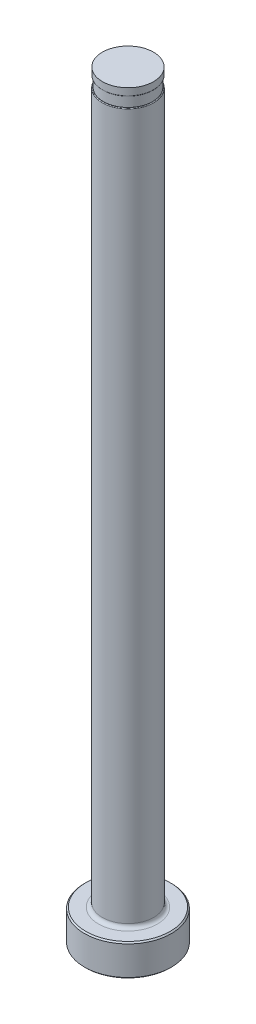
ISO-10303-21;
HEADER;
FILE_DESCRIPTION(('STEP AP214'),'2;1');
FILE_NAME('part.step','',(''),(''),'','','');
FILE_SCHEMA(('AUTOMOTIVE_DESIGN { 1 0 10303 214 1 1 1 1 }'));
ENDSEC;
DATA;
#1=APPLICATION_CONTEXT('core data for automotive mechanical design processes');
#2=APPLICATION_PROTOCOL_DEFINITION('international standard','automotive_design',2000,#1);
#3=PRODUCT_CONTEXT('',#1,'mechanical');
#4=PRODUCT('Part','Part','',(#3));
#5=PRODUCT_RELATED_PRODUCT_CATEGORY('part','',(#4));
#6=PRODUCT_DEFINITION_FORMATION('','',#4);
#7=PRODUCT_DEFINITION_CONTEXT('part definition',#1,'design');
#8=PRODUCT_DEFINITION('design','',#6,#7);
#9=PRODUCT_DEFINITION_SHAPE('','',#8);
#10=(LENGTH_UNIT() NAMED_UNIT(*) SI_UNIT(.MILLI.,.METRE.));
#11=(NAMED_UNIT(*) PLANE_ANGLE_UNIT() SI_UNIT($,.RADIAN.));
#12=(NAMED_UNIT(*) SI_UNIT($,.STERADIAN.) SOLID_ANGLE_UNIT());
#13=UNCERTAINTY_MEASURE_WITH_UNIT(LENGTH_MEASURE(1.E-05),#10,'distance_accuracy_value','');
#14=(GEOMETRIC_REPRESENTATION_CONTEXT(3) GLOBAL_UNCERTAINTY_ASSIGNED_CONTEXT((#13)) GLOBAL_UNIT_ASSIGNED_CONTEXT((#10,
#11,#12)) REPRESENTATION_CONTEXT('',''));
#15=CARTESIAN_POINT('',(0.,0.,0.));
#16=DIRECTION('',(0.,0.,1.));
#17=DIRECTION('',(1.,0.,0.));
#18=AXIS2_PLACEMENT_3D('',#15,#16,#17);
#19=CARTESIAN_POINT('',(-5.15873999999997,150.876,0.));
#20=DIRECTION('',(0.,1.,0.));
#21=DIRECTION('',(0.,0.,1.));
#22=AXIS2_PLACEMENT_3D('',#19,#20,#21);
#23=PLANE('',#22);
#24=CARTESIAN_POINT('',(0.,150.876,0.));
#25=DIRECTION('',(0.,1.,0.));
#26=DIRECTION('',(0.,0.,1.));
#27=AXIS2_PLACEMENT_3D('',#24,#25,#26);
#28=CIRCLE('',#27,5.00633999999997);
#29=CARTESIAN_POINT('',(0.,150.876,5.00633999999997));
#30=VERTEX_POINT('',#29);
#31=EDGE_CURVE('E11',#30,#30,#28,.F.);
#32=ORIENTED_EDGE('',*,*,#31,.T.);
#33=EDGE_LOOP('',(#32));
#34=FACE_BOUND('',#33,.T.);
#35=CARTESIAN_POINT('',(0.,150.876,0.));
#36=DIRECTION('',(0.,1.,0.));
#37=DIRECTION('',(0.,0.,1.));
#38=AXIS2_PLACEMENT_3D('',#35,#36,#37);
#39=CIRCLE('',#38,4.95553999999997);
#40=CARTESIAN_POINT('',(0.,150.876,4.95553999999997));
#41=VERTEX_POINT('',#40);
#42=EDGE_CURVE('E78',#41,#41,#39,.T.);
#43=ORIENTED_EDGE('',*,*,#42,.T.);
#44=EDGE_LOOP('',(#43));
#45=FACE_BOUND('',#44,.T.);
#46=ADVANCED_FACE('F36',(#34,#45),#23,.F.);
#47=CARTESIAN_POINT('',(0.,259.958771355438,0.));
#48=DIRECTION('',(0.,1.,0.));
#49=DIRECTION('',(0.,0.,1.));
#50=AXIS2_PLACEMENT_3D('',#47,#48,#49);
#51=CYLINDRICAL_SURFACE('',#50,5.15873999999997);
#52=DIRECTION('',(0.,1.,0.));
#53=VECTOR('',#52,1.);
#54=CARTESIAN_POINT('',(-4.95553999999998,259.958771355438,-1.43360444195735));
#55=LINE('',#54,#53);
#56=CARTESIAN_POINT('',(-4.95553999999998,148.717,-1.43360444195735));
#57=VERTEX_POINT('',#56);
#58=CARTESIAN_POINT('',(-4.95553999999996,86.36,-1.43360444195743));
#59=VERTEX_POINT('',#58);
#60=EDGE_CURVE('E73',#57,#59,#55,.F.);
#61=ORIENTED_EDGE('',*,*,#60,.F.);
#62=CARTESIAN_POINT('',(0.,148.717,0.));
#63=DIRECTION('',(0.,-1.,0.));
#64=DIRECTION('',(0.,0.,-1.));
#65=AXIS2_PLACEMENT_3D('',#62,#63,#64);
#66=CIRCLE('',#65,5.15873999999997);
#67=CARTESIAN_POINT('',(-4.95553999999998,148.717,1.43360444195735));
#68=VERTEX_POINT('',#67);
#69=EDGE_CURVE('E51',#57,#68,#66,.T.);
#70=ORIENTED_EDGE('',*,*,#69,.T.);
#71=DIRECTION('',(0.,1.,0.));
#72=VECTOR('',#71,1.);
#73=CARTESIAN_POINT('',(-4.95553999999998,259.958771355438,1.43360444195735));
#74=LINE('',#73,#72);
#75=CARTESIAN_POINT('',(-4.95553999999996,86.36,1.43360444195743));
#76=VERTEX_POINT('',#75);
#77=EDGE_CURVE('E84',#76,#68,#74,.T.);
#78=ORIENTED_EDGE('',*,*,#77,.F.);
#79=CARTESIAN_POINT('',(-4.95553999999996,86.36,-1.43360444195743));
#80=CARTESIAN_POINT('',(-4.95553725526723,86.3316189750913,-1.43360739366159));
#81=CARTESIAN_POINT('',(-4.95592104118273,86.3032557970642,-1.43228786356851));
#82=CARTESIAN_POINT('',(-4.95743326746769,86.2468072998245,-1.42704770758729));
#83=CARTESIAN_POINT('',(-4.9585612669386,86.2187218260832,-1.42312862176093));
#84=CARTESIAN_POINT('',(-4.9629961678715,86.1356356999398,-1.40761778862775));
#85=CARTESIAN_POINT('',(-4.96735491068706,86.0813485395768,-1.39227082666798));
#86=CARTESIAN_POINT('',(-4.97832723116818,85.9766470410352,-1.3525060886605));
#87=CARTESIAN_POINT('',(-4.98493672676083,85.92622589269,-1.32810472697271));
#88=CARTESIAN_POINT('',(-4.99967949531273,85.8301857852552,-1.27147840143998));
#89=CARTESIAN_POINT('',(-5.00781478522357,85.7845733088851,-1.23924306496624));
#90=CARTESIAN_POINT('',(-5.02495905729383,85.6982108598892,-1.16779718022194));
#91=CARTESIAN_POINT('',(-5.03397951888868,85.6575461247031,-1.12848730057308));
#92=CARTESIAN_POINT('',(-5.05205730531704,85.5821357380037,-1.04458765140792));
#93=CARTESIAN_POINT('',(-5.06111464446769,85.5473926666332,-0.999995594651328));
#94=CARTESIAN_POINT('',(-5.0828087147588,85.4687445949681,-0.884599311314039));
#95=CARTESIAN_POINT('',(-5.09511168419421,85.4282810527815,-0.811374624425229));
#96=CARTESIAN_POINT('',(-5.11705340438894,85.3595884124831,-0.659025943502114));
#97=CARTESIAN_POINT('',(-5.12668809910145,85.3313779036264,-0.579893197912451));
#98=CARTESIAN_POINT('',(-5.14250736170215,85.2862853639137,-0.417111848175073));
#99=CARTESIAN_POINT('',(-5.14864831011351,85.2695460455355,-0.333419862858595));
#100=CARTESIAN_POINT('',(-5.15681634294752,85.2474682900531,-0.164367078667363));
#101=CARTESIAN_POINT('',(-5.15884262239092,85.2421320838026,-0.0790059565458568));
#102=CARTESIAN_POINT('',(-5.15861184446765,85.2427349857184,0.105901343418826));
#103=CARTESIAN_POINT('',(-5.15558674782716,85.2506959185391,0.205446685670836));
#104=CARTESIAN_POINT('',(-5.14401053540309,85.2822458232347,0.401751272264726));
#105=CARTESIAN_POINT('',(-5.13546035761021,85.3058321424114,0.49851098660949));
#106=CARTESIAN_POINT('',(-5.11591338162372,85.3633193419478,0.667702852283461));
#107=CARTESIAN_POINT('',(-5.10571393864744,85.3943284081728,0.741210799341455));
#108=CARTESIAN_POINT('',(-5.08327564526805,85.467657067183,0.882022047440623));
#109=CARTESIAN_POINT('',(-5.07103965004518,85.509960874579,0.949333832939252));
#110=CARTESIAN_POINT('',(-5.04847334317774,85.5964217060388,1.06213618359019));
#111=CARTESIAN_POINT('',(-5.03826194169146,85.6384497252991,1.10927984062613));
#112=CARTESIAN_POINT('',(-5.01836605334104,85.7297827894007,1.19606762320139));
#113=CARTESIAN_POINT('',(-5.00868105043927,85.7790805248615,1.23571919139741));
#114=CARTESIAN_POINT('',(-4.99227488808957,85.8763011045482,1.30028176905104));
#115=CARTESIAN_POINT('',(-4.98532701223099,85.9233061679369,1.3265147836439));
#116=CARTESIAN_POINT('',(-4.97328889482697,86.0211640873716,1.37095861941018));
#117=CARTESIAN_POINT('',(-4.96819584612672,86.0720109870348,1.38918157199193));
#118=CARTESIAN_POINT('',(-4.96145831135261,86.1624594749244,1.41302693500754));
#119=CARTESIAN_POINT('',(-4.95925840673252,86.2014867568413,1.42070567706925));
#120=CARTESIAN_POINT('',(-4.95629015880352,86.2803307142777,1.43101136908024));
#121=CARTESIAN_POINT('',(-4.95552461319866,86.3201487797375,1.43362844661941));
#122=CARTESIAN_POINT('',(-4.95553999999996,86.36,1.43360444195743));
#123=B_SPLINE_CURVE_WITH_KNOTS('',3,(#79,#80,#81,#82,#83,#84,#85,#86,#87,#88,#89,#90,#91,#92,
#93,#94,#95,#96,#97,#98,#99,#100,#101,#102,#103,#104,#105,#106,#107,#108,#109,#110,#111,#112,
#113,#114,#115,#116,#117,#118,#119,#120,#121,#122),.UNSPECIFIED.,.F.,.F.,(4,2,2,2,2,2,2,2,2,2,2,
2,2,2,2,2,2,2,2,2,2,4),(0.,0.0850755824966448,0.170100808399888,0.338803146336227,
0.507201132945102,0.675823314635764,0.847029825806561,1.01831074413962,1.27062211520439,
1.52331494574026,1.77909706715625,2.03492922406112,2.33328986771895,2.63159987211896,
2.87199032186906,3.11204654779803,3.30325159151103,3.49426568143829,3.6564175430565,
3.81832296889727,3.9374932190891,4.05689566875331),.UNSPECIFIED.);
#124=EDGE_CURVE('E81',#59,#76,#123,.T.);
#125=ORIENTED_EDGE('',*,*,#124,.F.);
#126=EDGE_LOOP('',(#61,#70,#78,#125));
#127=FACE_BOUND('',#126,.T.);
#128=CARTESIAN_POINT('',(0.,7.11200000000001,0.));
#129=DIRECTION('',(0.,1.,0.));
#130=DIRECTION('',(0.,0.,1.));
#131=AXIS2_PLACEMENT_3D('',#128,#129,#130);
#132=CIRCLE('',#131,5.15873999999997);
#133=CARTESIAN_POINT('',(0.,7.11200000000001,5.15873999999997));
#134=VERTEX_POINT('',#133);
#135=EDGE_CURVE('E116',#134,#134,#132,.T.);
#136=ORIENTED_EDGE('',*,*,#135,.T.);
#137=EDGE_LOOP('',(#136));
#138=FACE_BOUND('',#137,.T.);
#139=ADVANCED_FACE('F82',(#127,#138),#51,.T.);
#140=CARTESIAN_POINT('',(0.,0.,0.));
#141=DIRECTION('',(0.,-1.,0.));
#142=DIRECTION('',(0.,0.,-1.));
#143=AXIS2_PLACEMENT_3D('',#140,#141,#142);
#144=PLANE('',#143);
#145=CARTESIAN_POINT('',(0.,0.,0.));
#146=DIRECTION('',(0.,-1.,0.));
#147=DIRECTION('',(0.,0.,-1.));
#148=AXIS2_PLACEMENT_3D('',#145,#146,#147);
#149=CIRCLE('',#148,8.47089999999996);
#150=CARTESIAN_POINT('',(0.,0.,-8.47089999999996));
#151=VERTEX_POINT('',#150);
#152=EDGE_CURVE('E113',#151,#151,#149,.T.);
#153=ORIENTED_EDGE('',*,*,#152,.T.);
#154=EDGE_LOOP('',(#153));
#155=FACE_BOUND('',#154,.T.);
#156=ADVANCED_FACE('F192',(#155),#144,.T.);
#157=CARTESIAN_POINT('',(0.,259.958771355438,0.));
#158=DIRECTION('',(0.,1.,0.));
#159=DIRECTION('',(0.,0.,1.));
#160=AXIS2_PLACEMENT_3D('',#157,#158,#159);
#161=CYLINDRICAL_SURFACE('',#160,8.72489999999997);
#162=CARTESIAN_POINT('',(0.,6.09600000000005,0.));
#163=DIRECTION('',(0.,1.,0.));
#164=DIRECTION('',(0.,0.,1.));
#165=AXIS2_PLACEMENT_3D('',#162,#163,#164);
#166=CIRCLE('',#165,8.72489999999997);
#167=CARTESIAN_POINT('',(0.,6.09600000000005,8.72489999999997));
#168=VERTEX_POINT('',#167);
#169=EDGE_CURVE('E110',#168,#168,#166,.F.);
#170=ORIENTED_EDGE('',*,*,#169,.T.);
#171=EDGE_LOOP('',(#170));
#172=FACE_BOUND('',#171,.T.);
#173=CARTESIAN_POINT('',(0.,0.254000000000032,0.));
#174=DIRECTION('',(0.,-1.,0.));
#175=DIRECTION('',(0.,0.,-1.));
#176=AXIS2_PLACEMENT_3D('',#173,#174,#175);
#177=CIRCLE('',#176,8.72489999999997);
#178=CARTESIAN_POINT('',(0.,0.254000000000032,-8.72489999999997));
#179=VERTEX_POINT('',#178);
#180=EDGE_CURVE('E107',#179,#179,#177,.F.);
#181=ORIENTED_EDGE('',*,*,#180,.T.);
#182=EDGE_LOOP('',(#181));
#183=FACE_BOUND('',#182,.T.);
#184=ADVANCED_FACE('F195',(#172,#183),#161,.T.);
#185=CARTESIAN_POINT('',(-8.72489999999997,6.35,0.));
#186=DIRECTION('',(0.,1.,0.));
#187=DIRECTION('',(0.,0.,1.));
#188=AXIS2_PLACEMENT_3D('',#185,#186,#187);
#189=PLANE('',#188);
#190=CARTESIAN_POINT('',(0.,6.35,0.));
#191=DIRECTION('',(0.,1.,0.));
#192=DIRECTION('',(0.,0.,1.));
#193=AXIS2_PLACEMENT_3D('',#190,#191,#192);
#194=CIRCLE('',#193,5.92073999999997);
#195=CARTESIAN_POINT('',(0.,6.35,5.92073999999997));
#196=VERTEX_POINT('',#195);
#197=EDGE_CURVE('E87',#196,#196,#194,.F.);
#198=ORIENTED_EDGE('',*,*,#197,.T.);
#199=EDGE_LOOP('',(#198));
#200=FACE_BOUND('',#199,.T.);
#201=CARTESIAN_POINT('',(0.,6.35,0.));
#202=DIRECTION('',(0.,1.,0.));
#203=DIRECTION('',(0.,0.,1.));
#204=AXIS2_PLACEMENT_3D('',#201,#202,#203);
#205=CIRCLE('',#204,8.47090000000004);
#206=CARTESIAN_POINT('',(0.,6.35,8.47090000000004));
#207=VERTEX_POINT('',#206);
#208=EDGE_CURVE('E104',#207,#207,#205,.T.);
#209=ORIENTED_EDGE('',*,*,#208,.T.);
#210=EDGE_LOOP('',(#209));
#211=FACE_BOUND('',#210,.T.);
#212=ADVANCED_FACE('F190',(#200,#211),#189,.T.);
#213=CARTESIAN_POINT('',(0.,6.35000000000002,0.));
#214=DIRECTION('',(0.,-1.,0.));
#215=DIRECTION('',(0.,0.,-1.));
#216=AXIS2_PLACEMENT_3D('',#213,#214,#215);
#217=CONICAL_SURFACE('',#216,8.47090000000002,0.785398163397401);
#218=ORIENTED_EDGE('',*,*,#169,.F.);
#219=EDGE_LOOP('',(#218));
#220=FACE_BOUND('',#219,.T.);
#221=ORIENTED_EDGE('',*,*,#208,.F.);
#222=EDGE_LOOP('',(#221));
#223=FACE_BOUND('',#222,.T.);
#224=ADVANCED_FACE('F186',(#220,#223),#217,.T.);
#225=CARTESIAN_POINT('',(0.,0.254000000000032,0.));
#226=DIRECTION('',(0.,1.,0.));
#227=DIRECTION('',(0.,0.,1.));
#228=AXIS2_PLACEMENT_3D('',#225,#226,#227);
#229=CONICAL_SURFACE('',#228,8.72489999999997,0.785398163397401);
#230=ORIENTED_EDGE('',*,*,#152,.F.);
#231=EDGE_LOOP('',(#230));
#232=FACE_BOUND('',#231,.T.);
#233=ORIENTED_EDGE('',*,*,#180,.F.);
#234=EDGE_LOOP('',(#233));
#235=FACE_BOUND('',#234,.T.);
#236=ADVANCED_FACE('F182',(#232,#235),#229,.T.);
#237=CARTESIAN_POINT('',(0.,7.11200000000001,0.));
#238=DIRECTION('',(0.,1.,0.));
#239=DIRECTION('',(0.,0.,1.));
#240=AXIS2_PLACEMENT_3D('',#237,#238,#239);
#241=TOROIDAL_SURFACE('',#240,5.92073999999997,0.762);
#242=ORIENTED_EDGE('',*,*,#197,.F.);
#243=EDGE_LOOP('',(#242));
#244=FACE_BOUND('',#243,.T.);
#245=ORIENTED_EDGE('',*,*,#135,.F.);
#246=EDGE_LOOP('',(#245));
#247=FACE_BOUND('',#246,.T.);
#248=ADVANCED_FACE('F147',(#244,#247),#241,.F.);
#249=CARTESIAN_POINT('',(-5.15873999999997,148.844,0.));
#250=DIRECTION('',(0.,-1.,0.));
#251=DIRECTION('',(0.,0.,-1.));
#252=AXIS2_PLACEMENT_3D('',#249,#250,#251);
#253=PLANE('',#252);
#254=DIRECTION('',(0.,0.,1.));
#255=VECTOR('',#254,1.);
#256=CARTESIAN_POINT('',(-4.95553999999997,148.844,0.));
#257=LINE('',#256,#255);
#258=CARTESIAN_POINT('',(-4.95553999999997,148.844,0.));
#259=VERTEX_POINT('',#258);
#260=CARTESIAN_POINT('',(-4.95553999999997,148.844,0.872370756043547));
#261=VERTEX_POINT('',#260);
#262=EDGE_CURVE('E90',#259,#261,#257,.T.);
#263=ORIENTED_EDGE('',*,*,#262,.T.);
#264=CARTESIAN_POINT('',(0.,148.844,0.));
#265=DIRECTION('',(0.,-1.,0.));
#266=DIRECTION('',(0.,0.,-1.));
#267=AXIS2_PLACEMENT_3D('',#264,#265,#266);
#268=CIRCLE('',#267,5.03173999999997);
#269=CARTESIAN_POINT('',(-4.95553999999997,148.844,-0.872370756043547));
#270=VERTEX_POINT('',#269);
#271=EDGE_CURVE('E86',#261,#270,#268,.F.);
#272=ORIENTED_EDGE('',*,*,#271,.T.);
#273=EDGE_CURVE('E79',#270,#259,#257,.T.);
#274=ORIENTED_EDGE('',*,*,#273,.T.);
#275=CARTESIAN_POINT('',(0.,148.844,0.));
#276=DIRECTION('',(0.,1.,0.));
#277=DIRECTION('',(0.,0.,1.));
#278=AXIS2_PLACEMENT_3D('',#275,#276,#277);
#279=CIRCLE('',#278,4.95553999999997);
#280=EDGE_CURVE('E101',#259,#259,#279,.T.);
#281=ORIENTED_EDGE('',*,*,#280,.F.);
#282=EDGE_LOOP('',(#263,#272,#274,#281));
#283=FACE_BOUND('',#282,.T.);
#284=ADVANCED_FACE('F144',(#283),#253,.F.);
#285=CARTESIAN_POINT('',(0.,153.448281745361,0.));
#286=DIRECTION('',(0.,1.,0.));
#287=DIRECTION('',(0.,0.,1.));
#288=AXIS2_PLACEMENT_3D('',#285,#286,#287);
#289=CYLINDRICAL_SURFACE('',#288,4.95553999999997);
#290=ORIENTED_EDGE('',*,*,#42,.F.);
#291=EDGE_LOOP('',(#290));
#292=FACE_BOUND('',#291,.T.);
#293=ORIENTED_EDGE('',*,*,#280,.T.);
#294=EDGE_LOOP('',(#293));
#295=FACE_BOUND('',#294,.T.);
#296=ADVANCED_FACE('F141',(#292,#295),#289,.T.);
#297=CARTESIAN_POINT('',(-4.95553999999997,149.86,-8.72489999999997));
#298=DIRECTION('',(1.,0.,0.));
#299=DIRECTION('',(0.,1.,0.));
#300=AXIS2_PLACEMENT_3D('',#297,#298,#299);
#301=PLANE('',#300);
#302=ORIENTED_EDGE('',*,*,#273,.F.);
#303=CARTESIAN_POINT('',(-4.95553999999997,148.844,-0.872370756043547));
#304=CARTESIAN_POINT('',(-4.95553999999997,148.843997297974,-0.893106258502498));
#305=CARTESIAN_POINT('',(-4.95553999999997,148.843847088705,-0.913843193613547));
#306=CARTESIAN_POINT('',(-4.95553999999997,148.843170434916,-0.955336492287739));
#307=CARTESIAN_POINT('',(-4.95553999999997,148.842643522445,-0.976092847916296));
#308=CARTESIAN_POINT('',(-4.95553999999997,148.841099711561,-1.01847199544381));
#309=CARTESIAN_POINT('',(-4.95553999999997,148.84006293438,-1.04009410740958));
#310=CARTESIAN_POINT('',(-4.95553999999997,148.837368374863,-1.08327970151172));
#311=CARTESIAN_POINT('',(-4.95553999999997,148.835711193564,-1.10484322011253));
#312=CARTESIAN_POINT('',(-4.95553999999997,148.831606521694,-1.14789214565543));
#313=CARTESIAN_POINT('',(-4.95553999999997,148.829159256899,-1.16937757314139));
#314=CARTESIAN_POINT('',(-4.95553999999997,148.823206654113,-1.21226394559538));
#315=CARTESIAN_POINT('',(-4.95553999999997,148.819698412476,-1.2336644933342));
#316=CARTESIAN_POINT('',(-4.95553999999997,148.811283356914,-1.2757822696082));
#317=CARTESIAN_POINT('',(-4.95553999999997,148.80640504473,-1.2965046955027));
#318=CARTESIAN_POINT('',(-4.95553999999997,148.797386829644,-1.32704228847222));
#319=CARTESIAN_POINT('',(-4.95553999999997,148.794106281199,-1.3371091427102));
#320=CARTESIAN_POINT('',(-4.95553999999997,148.78676790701,-1.35695139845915));
#321=CARTESIAN_POINT('',(-4.95553999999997,148.782711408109,-1.36672726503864));
#322=CARTESIAN_POINT('',(-4.95553999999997,148.775963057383,-1.38055335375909));
#323=CARTESIAN_POINT('',(-4.95553999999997,148.773728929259,-1.38482589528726));
#324=CARTESIAN_POINT('',(-4.95553999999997,148.768950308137,-1.39320953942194));
#325=CARTESIAN_POINT('',(-4.95553999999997,148.766405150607,-1.39732027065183));
#326=CARTESIAN_POINT('',(-4.95553999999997,148.760903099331,-1.40530983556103));
#327=CARTESIAN_POINT('',(-4.95553999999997,148.757943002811,-1.4091864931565));
#328=CARTESIAN_POINT('',(-4.95553999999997,148.751504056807,-1.4164922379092));
#329=CARTESIAN_POINT('',(-4.95553999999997,148.748026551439,-1.41992244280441));
#330=CARTESIAN_POINT('',(-4.95553999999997,148.742255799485,-1.4245087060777));
#331=CARTESIAN_POINT('',(-4.95553999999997,148.740201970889,-1.42596287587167));
#332=CARTESIAN_POINT('',(-4.95553999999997,148.735918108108,-1.42856560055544));
#333=CARTESIAN_POINT('',(-4.95553999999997,148.73368896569,-1.42971558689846));
#334=CARTESIAN_POINT('',(-4.95553999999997,148.729116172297,-1.43159125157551));
#335=CARTESIAN_POINT('',(-4.95553999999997,148.726776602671,-1.4323265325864));
#336=CARTESIAN_POINT('',(-4.95553999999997,148.721963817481,-1.43334161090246));
#337=CARTESIAN_POINT('',(-4.95553999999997,148.719489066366,-1.43361396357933));
#338=CARTESIAN_POINT('',(-4.95553999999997,148.717,-1.4336044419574));
#339=B_SPLINE_CURVE_WITH_KNOTS('',3,(#303,#304,#305,#306,#307,#308,#309,#310,#311,#312,#313,
#314,#315,#316,#317,#318,#319,#320,#321,#322,#323,#324,#325,#326,#327,#328,#329,#330,#331,#332,
#333,#334,#335,#336,#337,#338),.UNSPECIFIED.,.F.,.F.,(4,2,2,2,2,2,2,2,2,2,2,2,2,2,2,2,2,4),(0.,
0.0622081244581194,0.124493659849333,0.189427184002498,0.254297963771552,0.319150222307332,
0.384181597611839,0.447949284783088,0.479695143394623,0.51138719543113,0.525842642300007,
0.540329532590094,0.554935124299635,0.569503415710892,0.577034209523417,0.584528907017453,
0.591842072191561,0.599271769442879),.UNSPECIFIED.);
#340=EDGE_CURVE('E59',#270,#57,#339,.T.);
#341=ORIENTED_EDGE('',*,*,#340,.T.);
#342=ORIENTED_EDGE('',*,*,#60,.T.);
#343=DIRECTION('',(0.,0.,1.));
#344=VECTOR('',#343,1.);
#345=CARTESIAN_POINT('',(-4.95553999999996,86.36,-8.72489999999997));
#346=LINE('',#345,#344);
#347=EDGE_CURVE('E77',#59,#76,#346,.T.);
#348=ORIENTED_EDGE('',*,*,#347,.T.);
#349=ORIENTED_EDGE('',*,*,#77,.T.);
#350=CARTESIAN_POINT('',(-4.95553999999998,148.717,1.43360444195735));
#351=CARTESIAN_POINT('',(-4.95553999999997,148.719376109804,1.43361259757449));
#352=CARTESIAN_POINT('',(-4.95553999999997,148.721740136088,1.4333648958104));
#353=CARTESIAN_POINT('',(-4.95553999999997,148.726346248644,1.43243706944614));
#354=CARTESIAN_POINT('',(-4.95553999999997,148.728589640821,1.43176356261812));
#355=CARTESIAN_POINT('',(-4.95553999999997,148.733448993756,1.4298565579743));
#356=CARTESIAN_POINT('',(-4.95553999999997,148.736026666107,1.42852797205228));
#357=CARTESIAN_POINT('',(-4.95553999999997,148.740948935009,1.42547523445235));
#358=CARTESIAN_POINT('',(-4.95553999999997,148.743291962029,1.42374864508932));
#359=CARTESIAN_POINT('',(-4.95553999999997,148.749411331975,1.4186377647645));
#360=CARTESIAN_POINT('',(-4.95553999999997,148.752953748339,1.41497736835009));
#361=CARTESIAN_POINT('',(-4.95553999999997,148.759498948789,1.40721445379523));
#362=CARTESIAN_POINT('',(-4.95553999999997,148.762500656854,1.40311107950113));
#363=CARTESIAN_POINT('',(-4.95553999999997,148.769478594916,1.39255193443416));
#364=CARTESIAN_POINT('',(-4.95553999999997,148.773205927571,1.38593356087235));
#365=CARTESIAN_POINT('',(-4.95553999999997,148.780038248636,1.37237820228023));
#366=CARTESIAN_POINT('',(-4.95553999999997,148.783141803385,1.36544052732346));
#367=CARTESIAN_POINT('',(-4.95553999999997,148.791787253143,1.34428318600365));
#368=CARTESIAN_POINT('',(-4.95553999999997,148.796628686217,1.32978099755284));
#369=CARTESIAN_POINT('',(-4.95553999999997,148.809034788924,1.28723764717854));
#370=CARTESIAN_POINT('',(-4.95553999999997,148.815113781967,1.25878972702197));
#371=CARTESIAN_POINT('',(-4.95553999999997,148.825029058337,1.20147182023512));
#372=CARTESIAN_POINT('',(-4.95553999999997,148.828859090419,1.17260088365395));
#373=CARTESIAN_POINT('',(-4.95553999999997,148.834985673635,1.1146900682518));
#374=CARTESIAN_POINT('',(-4.95553999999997,148.837281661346,1.08565013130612));
#375=CARTESIAN_POINT('',(-4.95553999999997,148.840773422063,1.02754153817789));
#376=CARTESIAN_POINT('',(-4.95553999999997,148.841970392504,0.998472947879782));
#377=CARTESIAN_POINT('',(-4.95553999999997,148.84319494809,0.953200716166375));
#378=CARTESIAN_POINT('',(-4.95553999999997,148.843505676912,0.937003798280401));
#379=CARTESIAN_POINT('',(-4.95553999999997,148.843907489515,0.90466142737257));
#380=CARTESIAN_POINT('',(-4.95553999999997,148.843999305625,0.888515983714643));
#381=CARTESIAN_POINT('',(-4.95553999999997,148.844,0.872370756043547));
#382=B_SPLINE_CURVE_WITH_KNOTS('',3,(#350,#351,#352,#353,#354,#355,#356,#357,#358,#359,#360,
#361,#362,#363,#364,#365,#366,#367,#368,#369,#370,#371,#372,#373,#374,#375,#376,#377,#378,#379,
#380,#381),.UNSPECIFIED.,.F.,.F.,(4,2,2,2,2,2,2,2,2,2,2,2,2,2,2,4),(0.,0.00709610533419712,
0.0140845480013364,0.0227350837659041,0.0314400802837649,0.0466358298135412,0.0618614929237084,
0.084591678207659,0.107373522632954,0.15314866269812,0.240236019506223,0.327564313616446,
0.414924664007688,0.502189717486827,0.550788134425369,0.599223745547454),.UNSPECIFIED.);
#383=EDGE_CURVE('E172',#68,#261,#382,.T.);
#384=ORIENTED_EDGE('',*,*,#383,.T.);
#385=ORIENTED_EDGE('',*,*,#262,.F.);
#386=EDGE_LOOP('',(#302,#341,#342,#348,#349,#384,#385));
#387=FACE_BOUND('',#386,.T.);
#388=ADVANCED_FACE('F75',(#387),#301,.F.);
#389=CARTESIAN_POINT('',(-8.13053999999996,86.36,-8.72489999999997));
#390=DIRECTION('',(0.,0.,1.));
#391=DIRECTION('',(1.,0.,0.));
#392=AXIS2_PLACEMENT_3D('',#389,#390,#391);
#393=CYLINDRICAL_SURFACE('',#392,3.175);
#394=ORIENTED_EDGE('',*,*,#347,.F.);
#395=ORIENTED_EDGE('',*,*,#124,.T.);
#396=EDGE_LOOP('',(#394,#395));
#397=FACE_BOUND('',#396,.T.);
#398=ADVANCED_FACE('F89',(#397),#393,.F.);
#399=CARTESIAN_POINT('',(0.,152.687735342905,0.));
#400=DIRECTION('',(0.,1.,0.));
#401=DIRECTION('',(0.,0.,1.));
#402=AXIS2_PLACEMENT_3D('',#399,#400,#401);
#403=CYLINDRICAL_SURFACE('',#402,5.13333999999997);
#404=CARTESIAN_POINT('',(0.,151.003,0.));
#405=DIRECTION('',(0.,1.,0.));
#406=DIRECTION('',(0.,0.,1.));
#407=AXIS2_PLACEMENT_3D('',#404,#405,#406);
#408=CIRCLE('',#407,5.13333999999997);
#409=CARTESIAN_POINT('',(0.,151.003,5.13333999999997));
#410=VERTEX_POINT('',#409);
#411=EDGE_CURVE('E44',#410,#410,#408,.T.);
#412=ORIENTED_EDGE('',*,*,#411,.T.);
#413=EDGE_LOOP('',(#412));
#414=FACE_BOUND('',#413,.T.);
#415=CARTESIAN_POINT('',(0.,152.4,0.));
#416=DIRECTION('',(0.,1.,0.));
#417=DIRECTION('',(0.,0.,1.));
#418=AXIS2_PLACEMENT_3D('',#415,#416,#417);
#419=CIRCLE('',#418,5.13333999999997);
#420=CARTESIAN_POINT('',(0.,152.4,5.13333999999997));
#421=VERTEX_POINT('',#420);
#422=EDGE_CURVE('E91',#421,#421,#419,.T.);
#423=ORIENTED_EDGE('',*,*,#422,.F.);
#424=EDGE_LOOP('',(#423));
#425=FACE_BOUND('',#424,.T.);
#426=ADVANCED_FACE('F135',(#414,#425),#403,.T.);
#427=CARTESIAN_POINT('',(-5.15873999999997,152.4,0.));
#428=DIRECTION('',(0.,1.,0.));
#429=DIRECTION('',(0.,0.,1.));
#430=AXIS2_PLACEMENT_3D('',#427,#428,#429);
#431=PLANE('',#430);
#432=ORIENTED_EDGE('',*,*,#422,.T.);
#433=EDGE_LOOP('',(#432));
#434=FACE_BOUND('',#433,.T.);
#435=ADVANCED_FACE('F149',(#434),#431,.T.);
#436=CARTESIAN_POINT('',(0.,148.717,0.));
#437=DIRECTION('',(0.,-1.,0.));
#438=DIRECTION('',(0.,0.,-1.));
#439=AXIS2_PLACEMENT_3D('',#436,#437,#438);
#440=TOROIDAL_SURFACE('',#439,5.03173999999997,0.127);
#441=ORIENTED_EDGE('',*,*,#383,.F.);
#442=ORIENTED_EDGE('',*,*,#69,.F.);
#443=ORIENTED_EDGE('',*,*,#340,.F.);
#444=ORIENTED_EDGE('',*,*,#271,.F.);
#445=EDGE_LOOP('',(#441,#442,#443,#444));
#446=FACE_BOUND('',#445,.T.);
#447=ADVANCED_FACE('F151',(#446),#440,.T.);
#448=CARTESIAN_POINT('',(0.,151.003,0.));
#449=DIRECTION('',(0.,1.,0.));
#450=DIRECTION('',(0.,0.,1.));
#451=AXIS2_PLACEMENT_3D('',#448,#449,#450);
#452=TOROIDAL_SURFACE('',#451,5.00633999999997,0.127);
#453=ORIENTED_EDGE('',*,*,#31,.F.);
#454=EDGE_LOOP('',(#453));
#455=FACE_BOUND('',#454,.T.);
#456=ORIENTED_EDGE('',*,*,#411,.F.);
#457=EDGE_LOOP('',(#456));
#458=FACE_BOUND('',#457,.T.);
#459=ADVANCED_FACE('F38',(#455,#458),#452,.T.);
#460=CLOSED_SHELL('',(#46,#139,#156,#184,#212,#224,#236,#248,#284,#296,#388,#398,#426,#435,#447,#459));
#461=MANIFOLD_SOLID_BREP('B2',#460);
#462=ADVANCED_BREP_SHAPE_REPRESENTATION('',(#18,#461),#14);
#463=SHAPE_DEFINITION_REPRESENTATION(#9,#462);
ENDSEC;
END-ISO-10303-21;
